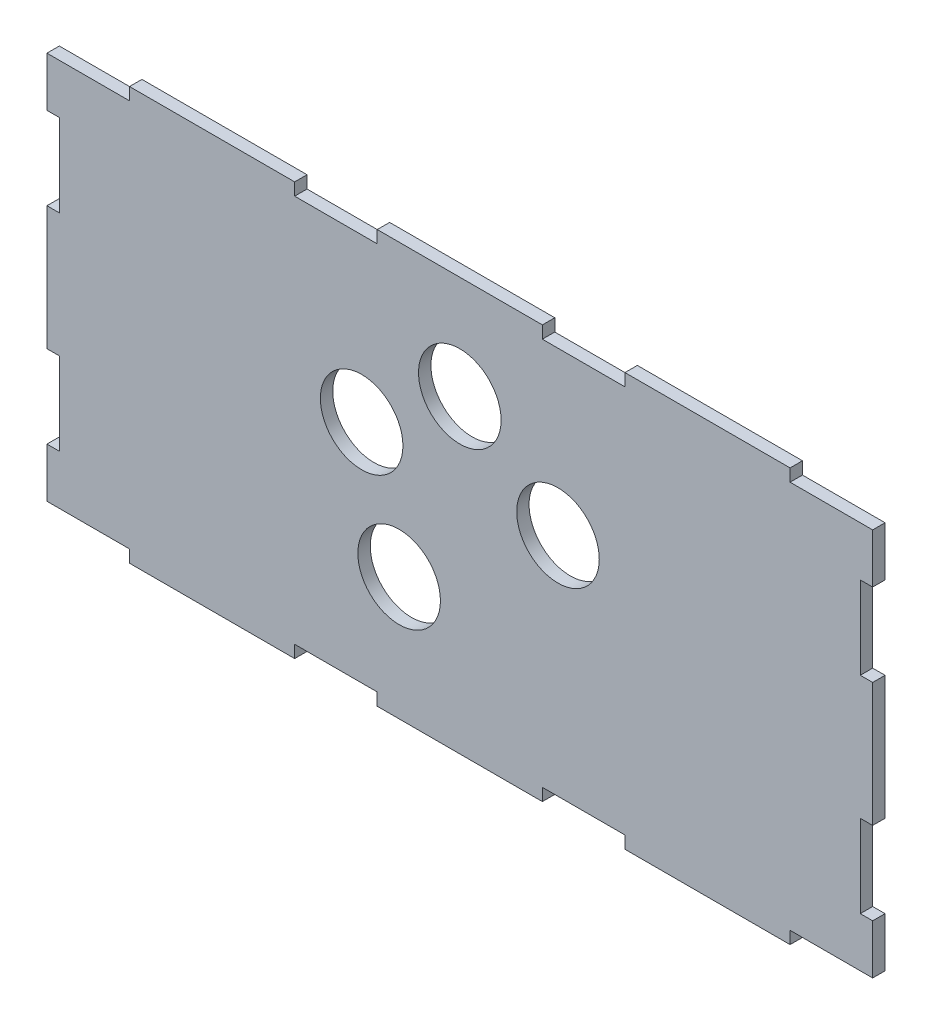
from build123d import *

# Parameters (mm, degrees)
SKETCH_1_W          = 200
SKETCH_1_H          = 100
SKETCH_1_R          = 10
EXTRUDE_1_DEPTH     = 3
SKETCH_2_W          = 20
SKETCH_2_H          = 3
SKETCH_2_W_2        = 3
SKETCH_2_H_2        = 20
CUT_EXTRUDE_1_DEPTH = 10


with BuildPart() as part:
    # Sketch 1 → Extrude 1 (new body)
    with BuildSketch(Plane.XY):
        Rectangle(SKETCH_1_W, SKETCH_1_H)
        with Locations((0, 25)):
            Circle(SKETCH_1_R, mode=Mode.SUBTRACT)
        with Locations((23.776412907, 7.725424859)):
            Circle(SKETCH_1_R, mode=Mode.SUBTRACT)
        with Locations((-14.694631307, -20.225424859)):
            Circle(SKETCH_1_R, mode=Mode.SUBTRACT)
        with Locations((-23.776412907, 7.725424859)):
            Circle(SKETCH_1_R, mode=Mode.SUBTRACT)
    extrude(amount=EXTRUDE_1_DEPTH)

    # Sketch 2 → Cut-Extrude 1 (cut)
    with BuildSketch(Plane.XY.offset(3)):
        with Locations((-30, -48.5)):
            Rectangle(SKETCH_2_W, SKETCH_2_H)
        with Locations((30, -48.5)):
            Rectangle(SKETCH_2_W, SKETCH_2_H)
        with Locations((-90, -48.5)):
            Rectangle(SKETCH_2_W, SKETCH_2_H)
        with Locations((-98.5, 25)):
            Rectangle(SKETCH_2_W_2, SKETCH_2_H_2)
        with Locations((-98.5, -25)):
            Rectangle(SKETCH_2_W_2, SKETCH_2_H_2)
        with Locations((98.5, -25)):
            Rectangle(SKETCH_2_W_2, SKETCH_2_H_2)
        with Locations((98.5, 25)):
            Rectangle(SKETCH_2_W_2, SKETCH_2_H_2)
        with Locations((90, -48.5)):
            Rectangle(SKETCH_2_W, SKETCH_2_H)
        with Locations((90, 48.5)):
            Rectangle(SKETCH_2_W, SKETCH_2_H)
        with Locations((-90, 48.5)):
            Rectangle(SKETCH_2_W, SKETCH_2_H)
        with Locations((30, 48.5)):
            Rectangle(SKETCH_2_W, SKETCH_2_H)
        with Locations((-30, 48.5)):
            Rectangle(SKETCH_2_W, SKETCH_2_H)
    extrude(amount=-CUT_EXTRUDE_1_DEPTH, mode=Mode.SUBTRACT)


solid = part.part
